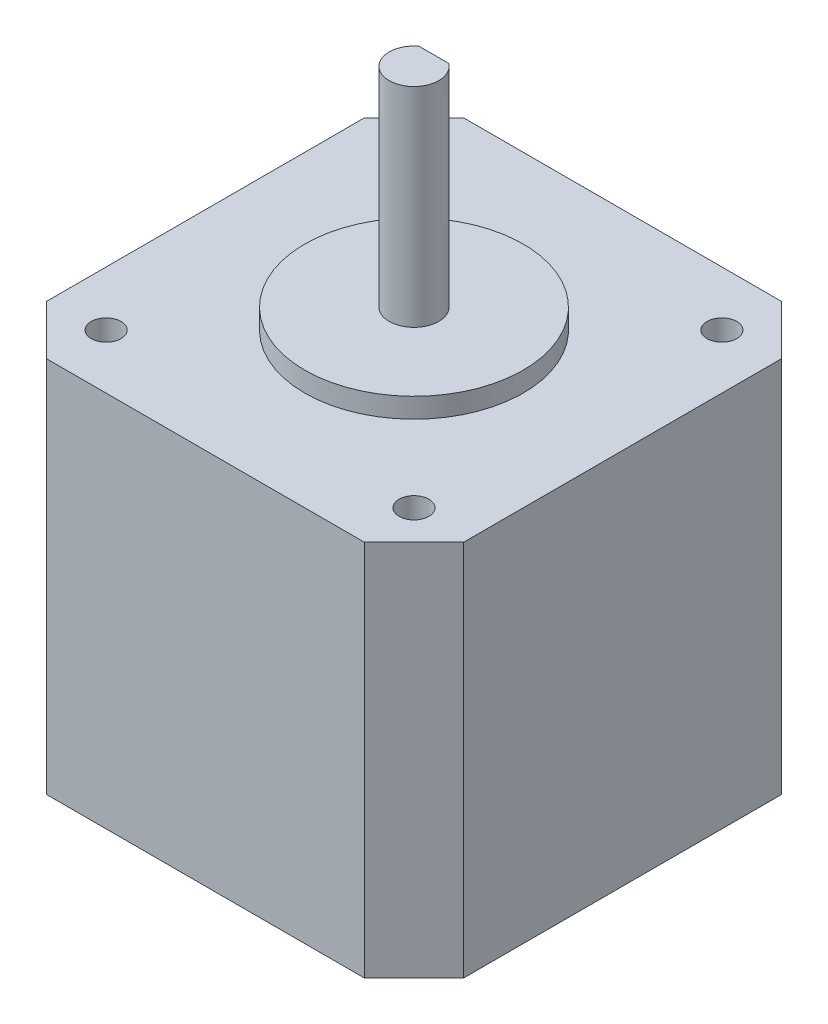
ISO-10303-21;
HEADER;
FILE_DESCRIPTION(('STEP AP214'),'2;1');
FILE_NAME('part.step','',(''),(''),'','','');
FILE_SCHEMA(('AUTOMOTIVE_DESIGN { 1 0 10303 214 1 1 1 1 }'));
ENDSEC;
DATA;
#1=APPLICATION_CONTEXT('core data for automotive mechanical design processes');
#2=APPLICATION_PROTOCOL_DEFINITION('international standard','automotive_design',2000,#1);
#3=PRODUCT_CONTEXT('',#1,'mechanical');
#4=PRODUCT('Part','Part','',(#3));
#5=PRODUCT_RELATED_PRODUCT_CATEGORY('part','',(#4));
#6=PRODUCT_DEFINITION_FORMATION('','',#4);
#7=PRODUCT_DEFINITION_CONTEXT('part definition',#1,'design');
#8=PRODUCT_DEFINITION('design','',#6,#7);
#9=PRODUCT_DEFINITION_SHAPE('','',#8);
#10=(LENGTH_UNIT() NAMED_UNIT(*) SI_UNIT(.MILLI.,.METRE.));
#11=(NAMED_UNIT(*) PLANE_ANGLE_UNIT() SI_UNIT($,.RADIAN.));
#12=(NAMED_UNIT(*) SI_UNIT($,.STERADIAN.) SOLID_ANGLE_UNIT());
#13=UNCERTAINTY_MEASURE_WITH_UNIT(LENGTH_MEASURE(1.E-05),#10,'distance_accuracy_value','');
#14=(GEOMETRIC_REPRESENTATION_CONTEXT(3) GLOBAL_UNCERTAINTY_ASSIGNED_CONTEXT((#13)) GLOBAL_UNIT_ASSIGNED_CONTEXT((#10,
#11,#12)) REPRESENTATION_CONTEXT('',''));
#15=CARTESIAN_POINT('',(0.,0.,0.));
#16=DIRECTION('',(0.,0.,1.));
#17=DIRECTION('',(1.,0.,0.));
#18=AXIS2_PLACEMENT_3D('',#15,#16,#17);
#19=CARTESIAN_POINT('',(-21.,38.,21.));
#20=DIRECTION('',(1.,0.,0.));
#21=DIRECTION('',(0.,0.,-1.));
#22=AXIS2_PLACEMENT_3D('',#19,#20,#21);
#23=PLANE('',#22);
#24=DIRECTION('',(0.,0.,1.));
#25=VECTOR('',#24,1.);
#26=CARTESIAN_POINT('',(-21.,0.,21.));
#27=LINE('',#26,#25);
#28=CARTESIAN_POINT('',(-21.,0.,-16.));
#29=VERTEX_POINT('',#28);
#30=CARTESIAN_POINT('',(-21.,0.,16.));
#31=VERTEX_POINT('',#30);
#32=EDGE_CURVE('E142',#29,#31,#27,.T.);
#33=ORIENTED_EDGE('',*,*,#32,.T.);
#34=DIRECTION('',(0.,1.,0.));
#35=VECTOR('',#34,1.);
#36=CARTESIAN_POINT('',(-21.,38.,16.));
#37=LINE('',#36,#35);
#38=CARTESIAN_POINT('',(-21.,38.,16.));
#39=VERTEX_POINT('',#38);
#40=EDGE_CURVE('E130',#31,#39,#37,.T.);
#41=ORIENTED_EDGE('',*,*,#40,.T.);
#42=DIRECTION('',(0.,0.,1.));
#43=VECTOR('',#42,1.);
#44=CARTESIAN_POINT('',(-21.,38.,21.));
#45=LINE('',#44,#43);
#46=CARTESIAN_POINT('',(-21.,38.,-16.));
#47=VERTEX_POINT('',#46);
#48=EDGE_CURVE('E157',#47,#39,#45,.T.);
#49=ORIENTED_EDGE('',*,*,#48,.F.);
#50=DIRECTION('',(0.,-1.,0.));
#51=VECTOR('',#50,1.);
#52=CARTESIAN_POINT('',(-21.,38.,-16.));
#53=LINE('',#52,#51);
#54=EDGE_CURVE('E206',#47,#29,#53,.T.);
#55=ORIENTED_EDGE('',*,*,#54,.T.);
#56=EDGE_LOOP('',(#33,#41,#49,#55));
#57=FACE_BOUND('',#56,.T.);
#58=ADVANCED_FACE('F45',(#57),#23,.F.);
#59=CARTESIAN_POINT('',(21.,38.,21.));
#60=DIRECTION('',(0.,0.,-1.));
#61=DIRECTION('',(-1.,0.,0.));
#62=AXIS2_PLACEMENT_3D('',#59,#60,#61);
#63=PLANE('',#62);
#64=DIRECTION('',(1.,0.,0.));
#65=VECTOR('',#64,1.);
#66=CARTESIAN_POINT('',(21.,0.,21.));
#67=LINE('',#66,#65);
#68=CARTESIAN_POINT('',(-16.,0.,21.));
#69=VERTEX_POINT('',#68);
#70=CARTESIAN_POINT('',(16.,0.,21.));
#71=VERTEX_POINT('',#70);
#72=EDGE_CURVE('E170',#69,#71,#67,.T.);
#73=ORIENTED_EDGE('',*,*,#72,.T.);
#74=DIRECTION('',(0.,1.,0.));
#75=VECTOR('',#74,1.);
#76=CARTESIAN_POINT('',(16.,38.,21.));
#77=LINE('',#76,#75);
#78=CARTESIAN_POINT('',(16.,38.,21.));
#79=VERTEX_POINT('',#78);
#80=EDGE_CURVE('E69',#71,#79,#77,.T.);
#81=ORIENTED_EDGE('',*,*,#80,.T.);
#82=DIRECTION('',(1.,0.,0.));
#83=VECTOR('',#82,1.);
#84=CARTESIAN_POINT('',(21.,38.,21.));
#85=LINE('',#84,#83);
#86=CARTESIAN_POINT('',(-16.,38.,21.));
#87=VERTEX_POINT('',#86);
#88=EDGE_CURVE('E160',#87,#79,#85,.T.);
#89=ORIENTED_EDGE('',*,*,#88,.F.);
#90=DIRECTION('',(0.,-1.,0.));
#91=VECTOR('',#90,1.);
#92=CARTESIAN_POINT('',(-16.,38.,21.));
#93=LINE('',#92,#91);
#94=EDGE_CURVE('E202',#87,#69,#93,.T.);
#95=ORIENTED_EDGE('',*,*,#94,.T.);
#96=EDGE_LOOP('',(#73,#81,#89,#95));
#97=FACE_BOUND('',#96,.T.);
#98=ADVANCED_FACE('F222',(#97),#63,.F.);
#99=CARTESIAN_POINT('',(21.,38.,21.));
#100=DIRECTION('',(-1.,0.,0.));
#101=DIRECTION('',(0.,0.,1.));
#102=AXIS2_PLACEMENT_3D('',#99,#100,#101);
#103=PLANE('',#102);
#104=DIRECTION('',(0.,0.,-1.));
#105=VECTOR('',#104,1.);
#106=CARTESIAN_POINT('',(21.,0.,21.));
#107=LINE('',#106,#105);
#108=CARTESIAN_POINT('',(21.,0.,16.));
#109=VERTEX_POINT('',#108);
#110=CARTESIAN_POINT('',(21.,0.,-16.));
#111=VERTEX_POINT('',#110);
#112=EDGE_CURVE('E172',#109,#111,#107,.T.);
#113=ORIENTED_EDGE('',*,*,#112,.T.);
#114=DIRECTION('',(0.,1.,0.));
#115=VECTOR('',#114,1.);
#116=CARTESIAN_POINT('',(21.,38.,-16.));
#117=LINE('',#116,#115);
#118=CARTESIAN_POINT('',(21.,38.,-16.));
#119=VERTEX_POINT('',#118);
#120=EDGE_CURVE('E192',#111,#119,#117,.T.);
#121=ORIENTED_EDGE('',*,*,#120,.T.);
#122=DIRECTION('',(0.,0.,-1.));
#123=VECTOR('',#122,1.);
#124=CARTESIAN_POINT('',(21.,38.,21.));
#125=LINE('',#124,#123);
#126=CARTESIAN_POINT('',(21.,38.,16.));
#127=VERTEX_POINT('',#126);
#128=EDGE_CURVE('E163',#127,#119,#125,.T.);
#129=ORIENTED_EDGE('',*,*,#128,.F.);
#130=DIRECTION('',(0.,-1.,0.));
#131=VECTOR('',#130,1.);
#132=CARTESIAN_POINT('',(21.,38.,16.));
#133=LINE('',#132,#131);
#134=EDGE_CURVE('E189',#127,#109,#133,.T.);
#135=ORIENTED_EDGE('',*,*,#134,.T.);
#136=EDGE_LOOP('',(#113,#121,#129,#135));
#137=FACE_BOUND('',#136,.T.);
#138=ADVANCED_FACE('F233',(#137),#103,.F.);
#139=CARTESIAN_POINT('',(21.,38.,-21.));
#140=DIRECTION('',(0.,0.,1.));
#141=DIRECTION('',(1.,0.,0.));
#142=AXIS2_PLACEMENT_3D('',#139,#140,#141);
#143=PLANE('',#142);
#144=DIRECTION('',(-1.,0.,0.));
#145=VECTOR('',#144,1.);
#146=CARTESIAN_POINT('',(21.,38.,-21.));
#147=LINE('',#146,#145);
#148=CARTESIAN_POINT('',(16.,38.,-21.));
#149=VERTEX_POINT('',#148);
#150=CARTESIAN_POINT('',(-16.,38.,-21.));
#151=VERTEX_POINT('',#150);
#152=EDGE_CURVE('E156',#149,#151,#147,.T.);
#153=ORIENTED_EDGE('',*,*,#152,.F.);
#154=DIRECTION('',(0.,-1.,0.));
#155=VECTOR('',#154,1.);
#156=CARTESIAN_POINT('',(16.,38.,-21.));
#157=LINE('',#156,#155);
#158=CARTESIAN_POINT('',(16.,0.,-21.));
#159=VERTEX_POINT('',#158);
#160=EDGE_CURVE('E178',#149,#159,#157,.T.);
#161=ORIENTED_EDGE('',*,*,#160,.T.);
#162=DIRECTION('',(-1.,0.,0.));
#163=VECTOR('',#162,1.);
#164=CARTESIAN_POINT('',(21.,0.,-21.));
#165=LINE('',#164,#163);
#166=CARTESIAN_POINT('',(-16.,0.,-21.));
#167=VERTEX_POINT('',#166);
#168=EDGE_CURVE('E161',#159,#167,#165,.T.);
#169=ORIENTED_EDGE('',*,*,#168,.T.);
#170=DIRECTION('',(0.,1.,0.));
#171=VECTOR('',#170,1.);
#172=CARTESIAN_POINT('',(-16.,38.,-21.));
#173=LINE('',#172,#171);
#174=EDGE_CURVE('E151',#167,#151,#173,.T.);
#175=ORIENTED_EDGE('',*,*,#174,.T.);
#176=EDGE_LOOP('',(#153,#161,#169,#175));
#177=FACE_BOUND('',#176,.T.);
#178=ADVANCED_FACE('F241',(#177),#143,.F.);
#179=CARTESIAN_POINT('',(0.,38.,0.));
#180=DIRECTION('',(0.,1.,0.));
#181=DIRECTION('',(0.,0.,1.));
#182=AXIS2_PLACEMENT_3D('',#179,#180,#181);
#183=PLANE('',#182);
#184=CARTESIAN_POINT('',(-15.5,38.,15.5));
#185=DIRECTION('',(0.,1.,0.));
#186=DIRECTION('',(0.,0.,-1.));
#187=AXIS2_PLACEMENT_3D('',#184,#185,#186);
#188=CIRCLE('',#187,1.5);
#189=CARTESIAN_POINT('',(-15.5,38.,14.));
#190=VERTEX_POINT('',#189);
#191=EDGE_CURVE('E471',#190,#190,#188,.T.);
#192=ORIENTED_EDGE('',*,*,#191,.F.);
#193=EDGE_LOOP('',(#192));
#194=FACE_BOUND('',#193,.T.);
#195=CARTESIAN_POINT('',(15.5,38.,15.5));
#196=DIRECTION('',(0.,1.,0.));
#197=DIRECTION('',(0.,0.,1.));
#198=AXIS2_PLACEMENT_3D('',#195,#196,#197);
#199=CIRCLE('',#198,1.5);
#200=CARTESIAN_POINT('',(15.5,38.,17.));
#201=VERTEX_POINT('',#200);
#202=EDGE_CURVE('E475',#201,#201,#199,.T.);
#203=ORIENTED_EDGE('',*,*,#202,.F.);
#204=EDGE_LOOP('',(#203));
#205=FACE_BOUND('',#204,.T.);
#206=CARTESIAN_POINT('',(15.5,38.,-15.5));
#207=DIRECTION('',(0.,1.,0.));
#208=DIRECTION('',(0.,0.,-1.));
#209=AXIS2_PLACEMENT_3D('',#206,#207,#208);
#210=CIRCLE('',#209,1.5);
#211=CARTESIAN_POINT('',(15.5,38.,-17.));
#212=VERTEX_POINT('',#211);
#213=EDGE_CURVE('E479',#212,#212,#210,.T.);
#214=ORIENTED_EDGE('',*,*,#213,.F.);
#215=EDGE_LOOP('',(#214));
#216=FACE_BOUND('',#215,.T.);
#217=CARTESIAN_POINT('',(-15.5,38.,-15.5));
#218=DIRECTION('',(0.,1.,0.));
#219=DIRECTION('',(0.,0.,1.));
#220=AXIS2_PLACEMENT_3D('',#217,#218,#219);
#221=CIRCLE('',#220,1.5);
#222=CARTESIAN_POINT('',(-15.5,38.,-14.));
#223=VERTEX_POINT('',#222);
#224=EDGE_CURVE('E145',#223,#223,#221,.T.);
#225=ORIENTED_EDGE('',*,*,#224,.F.);
#226=EDGE_LOOP('',(#225));
#227=FACE_BOUND('',#226,.T.);
#228=CARTESIAN_POINT('',(0.,38.,0.));
#229=DIRECTION('',(0.,1.,0.));
#230=DIRECTION('',(0.,0.,1.));
#231=AXIS2_PLACEMENT_3D('',#228,#229,#230);
#232=CIRCLE('',#231,11.);
#233=CARTESIAN_POINT('',(0.,38.,11.));
#234=VERTEX_POINT('',#233);
#235=EDGE_CURVE('E152',#234,#234,#232,.T.);
#236=ORIENTED_EDGE('',*,*,#235,.F.);
#237=EDGE_LOOP('',(#236));
#238=FACE_BOUND('',#237,.T.);
#239=ORIENTED_EDGE('',*,*,#128,.T.);
#240=DIRECTION('',(0.707106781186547,0.,0.707106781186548));
#241=VECTOR('',#240,1.);
#242=CARTESIAN_POINT('',(18.5,38.,-18.5));
#243=LINE('',#242,#241);
#244=EDGE_CURVE('E200',#119,#149,#243,.F.);
#245=ORIENTED_EDGE('',*,*,#244,.T.);
#246=ORIENTED_EDGE('',*,*,#152,.T.);
#247=DIRECTION('',(0.707106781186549,0.,-0.707106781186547));
#248=VECTOR('',#247,1.);
#249=CARTESIAN_POINT('',(-18.5,38.,-18.5));
#250=LINE('',#249,#248);
#251=EDGE_CURVE('E194',#151,#47,#250,.F.);
#252=ORIENTED_EDGE('',*,*,#251,.T.);
#253=ORIENTED_EDGE('',*,*,#48,.T.);
#254=DIRECTION('',(-0.707106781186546,0.,-0.70710678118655));
#255=VECTOR('',#254,1.);
#256=CARTESIAN_POINT('',(-18.5,38.,18.4999999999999));
#257=LINE('',#256,#255);
#258=EDGE_CURVE('E196',#39,#87,#257,.F.);
#259=ORIENTED_EDGE('',*,*,#258,.T.);
#260=ORIENTED_EDGE('',*,*,#88,.T.);
#261=DIRECTION('',(-0.707106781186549,0.,0.707106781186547));
#262=VECTOR('',#261,1.);
#263=CARTESIAN_POINT('',(18.5,38.,18.5));
#264=LINE('',#263,#262);
#265=EDGE_CURVE('E198',#79,#127,#264,.F.);
#266=ORIENTED_EDGE('',*,*,#265,.T.);
#267=EDGE_LOOP('',(#239,#245,#246,#252,#253,#259,#260,#266));
#268=FACE_BOUND('',#267,.T.);
#269=ADVANCED_FACE('F217',(#194,#205,#216,#227,#238,#268),#183,.T.);
#270=CARTESIAN_POINT('',(0.,0.,0.));
#271=DIRECTION('',(0.,1.,0.));
#272=DIRECTION('',(0.,0.,1.));
#273=AXIS2_PLACEMENT_3D('',#270,#271,#272);
#274=PLANE('',#273);
#275=ORIENTED_EDGE('',*,*,#168,.F.);
#276=DIRECTION('',(-0.707106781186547,0.,-0.707106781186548));
#277=VECTOR('',#276,1.);
#278=CARTESIAN_POINT('',(16.,0.,-21.));
#279=LINE('',#278,#277);
#280=EDGE_CURVE('E187',#159,#111,#279,.F.);
#281=ORIENTED_EDGE('',*,*,#280,.T.);
#282=ORIENTED_EDGE('',*,*,#112,.F.);
#283=DIRECTION('',(0.707106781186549,0.,-0.707106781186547));
#284=VECTOR('',#283,1.);
#285=CARTESIAN_POINT('',(21.,0.,16.));
#286=LINE('',#285,#284);
#287=EDGE_CURVE('E185',#109,#71,#286,.F.);
#288=ORIENTED_EDGE('',*,*,#287,.T.);
#289=ORIENTED_EDGE('',*,*,#72,.F.);
#290=DIRECTION('',(0.707106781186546,0.,0.70710678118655));
#291=VECTOR('',#290,1.);
#292=CARTESIAN_POINT('',(-16.,0.,21.));
#293=LINE('',#292,#291);
#294=EDGE_CURVE('E183',#69,#31,#293,.F.);
#295=ORIENTED_EDGE('',*,*,#294,.T.);
#296=ORIENTED_EDGE('',*,*,#32,.F.);
#297=DIRECTION('',(-0.707106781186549,0.,0.707106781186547));
#298=VECTOR('',#297,1.);
#299=CARTESIAN_POINT('',(-21.,0.,-16.));
#300=LINE('',#299,#298);
#301=EDGE_CURVE('E181',#29,#167,#300,.F.);
#302=ORIENTED_EDGE('',*,*,#301,.T.);
#303=EDGE_LOOP('',(#275,#281,#282,#288,#289,#295,#296,#302));
#304=FACE_BOUND('',#303,.T.);
#305=ADVANCED_FACE('F225',(#304),#274,.F.);
#306=CARTESIAN_POINT('',(0.,40.,0.));
#307=DIRECTION('',(0.,-1.,0.));
#308=DIRECTION('',(0.,0.,-1.));
#309=AXIS2_PLACEMENT_3D('',#306,#307,#308);
#310=CYLINDRICAL_SURFACE('',#309,11.);
#311=CARTESIAN_POINT('',(0.,40.,0.));
#312=DIRECTION('',(0.,1.,0.));
#313=DIRECTION('',(0.,0.,1.));
#314=AXIS2_PLACEMENT_3D('',#311,#312,#313);
#315=CIRCLE('',#314,11.);
#316=CARTESIAN_POINT('',(0.,40.,11.));
#317=VERTEX_POINT('',#316);
#318=EDGE_CURVE('E138',#317,#317,#315,.T.);
#319=ORIENTED_EDGE('',*,*,#318,.F.);
#320=EDGE_LOOP('',(#319));
#321=FACE_BOUND('',#320,.T.);
#322=ORIENTED_EDGE('',*,*,#235,.T.);
#323=EDGE_LOOP('',(#322));
#324=FACE_BOUND('',#323,.T.);
#325=ADVANCED_FACE('F346',(#321,#324),#310,.T.);
#326=CARTESIAN_POINT('',(0.,40.,0.));
#327=DIRECTION('',(0.,1.,0.));
#328=DIRECTION('',(0.,0.,1.));
#329=AXIS2_PLACEMENT_3D('',#326,#327,#328);
#330=PLANE('',#329);
#331=CARTESIAN_POINT('',(0.,40.,0.));
#332=DIRECTION('',(0.,1.,0.));
#333=DIRECTION('',(0.,0.,1.));
#334=AXIS2_PLACEMENT_3D('',#331,#332,#333);
#335=CIRCLE('',#334,2.5);
#336=CARTESIAN_POINT('',(0.,40.,2.5));
#337=VERTEX_POINT('',#336);
#338=EDGE_CURVE('E149',#337,#337,#335,.T.);
#339=ORIENTED_EDGE('',*,*,#338,.F.);
#340=EDGE_LOOP('',(#339));
#341=FACE_BOUND('',#340,.T.);
#342=ORIENTED_EDGE('',*,*,#318,.T.);
#343=EDGE_LOOP('',(#342));
#344=FACE_BOUND('',#343,.T.);
#345=ADVANCED_FACE('F343',(#341,#344),#330,.T.);
#346=CARTESIAN_POINT('',(0.,61.,0.));
#347=DIRECTION('',(0.,-1.,0.));
#348=DIRECTION('',(0.,0.,-1.));
#349=AXIS2_PLACEMENT_3D('',#346,#347,#348);
#350=CYLINDRICAL_SURFACE('',#349,2.5);
#351=CARTESIAN_POINT('',(0.,61.,0.));
#352=DIRECTION('',(0.,1.,0.));
#353=DIRECTION('',(0.,0.,1.));
#354=AXIS2_PLACEMENT_3D('',#351,#352,#353);
#355=CIRCLE('',#354,2.5);
#356=CARTESIAN_POINT('',(-1.5,61.,-2.));
#357=VERTEX_POINT('',#356);
#358=CARTESIAN_POINT('',(1.5,61.,-2.));
#359=VERTEX_POINT('',#358);
#360=EDGE_CURVE('E134',#357,#359,#355,.T.);
#361=ORIENTED_EDGE('',*,*,#360,.F.);
#362=DIRECTION('',(0.,-1.,0.));
#363=VECTOR('',#362,1.);
#364=CARTESIAN_POINT('',(-1.5,61.,-2.));
#365=LINE('',#364,#363);
#366=CARTESIAN_POINT('',(-1.5,42.,-2.));
#367=VERTEX_POINT('',#366);
#368=EDGE_CURVE('E61',#357,#367,#365,.T.);
#369=ORIENTED_EDGE('',*,*,#368,.T.);
#370=CARTESIAN_POINT('',(0.,42.,0.));
#371=DIRECTION('',(0.,-1.,0.));
#372=DIRECTION('',(0.,0.,-1.));
#373=AXIS2_PLACEMENT_3D('',#370,#371,#372);
#374=CIRCLE('',#373,2.5);
#375=CARTESIAN_POINT('',(1.5,42.,-2.));
#376=VERTEX_POINT('',#375);
#377=EDGE_CURVE('E11',#367,#376,#374,.T.);
#378=ORIENTED_EDGE('',*,*,#377,.T.);
#379=DIRECTION('',(0.,-1.,0.));
#380=VECTOR('',#379,1.);
#381=CARTESIAN_POINT('',(1.5,61.,-2.));
#382=LINE('',#381,#380);
#383=EDGE_CURVE('E125',#376,#359,#382,.F.);
#384=ORIENTED_EDGE('',*,*,#383,.T.);
#385=EDGE_LOOP('',(#361,#369,#378,#384));
#386=FACE_BOUND('',#385,.T.);
#387=ORIENTED_EDGE('',*,*,#338,.T.);
#388=EDGE_LOOP('',(#387));
#389=FACE_BOUND('',#388,.T.);
#390=ADVANCED_FACE('F132',(#386,#389),#350,.T.);
#391=CARTESIAN_POINT('',(0.,61.,0.));
#392=DIRECTION('',(0.,1.,0.));
#393=DIRECTION('',(0.,0.,1.));
#394=AXIS2_PLACEMENT_3D('',#391,#392,#393);
#395=PLANE('',#394);
#396=DIRECTION('',(1.,0.,0.));
#397=VECTOR('',#396,1.);
#398=CARTESIAN_POINT('',(0.,61.,-2.));
#399=LINE('',#398,#397);
#400=EDGE_CURVE('E54',#357,#359,#399,.T.);
#401=ORIENTED_EDGE('',*,*,#400,.F.);
#402=ORIENTED_EDGE('',*,*,#360,.T.);
#403=EDGE_LOOP('',(#401,#402));
#404=FACE_BOUND('',#403,.T.);
#405=ADVANCED_FACE('F137',(#404),#395,.T.);
#406=CARTESIAN_POINT('',(-15.5,28.,-15.5));
#407=DIRECTION('',(0.,1.,0.));
#408=DIRECTION('',(0.,0.,1.));
#409=AXIS2_PLACEMENT_3D('',#406,#407,#408);
#410=CYLINDRICAL_SURFACE('',#409,1.5);
#411=CARTESIAN_POINT('',(-15.5,28.,-15.5));
#412=DIRECTION('',(0.,1.,0.));
#413=DIRECTION('',(0.,0.,1.));
#414=AXIS2_PLACEMENT_3D('',#411,#412,#413);
#415=CIRCLE('',#414,1.5);
#416=CARTESIAN_POINT('',(-15.5,28.,-14.));
#417=VERTEX_POINT('',#416);
#418=EDGE_CURVE('E139',#417,#417,#415,.T.);
#419=ORIENTED_EDGE('',*,*,#418,.F.);
#420=EDGE_LOOP('',(#419));
#421=FACE_BOUND('',#420,.T.);
#422=ORIENTED_EDGE('',*,*,#224,.T.);
#423=EDGE_LOOP('',(#422));
#424=FACE_BOUND('',#423,.T.);
#425=ADVANCED_FACE('F336',(#421,#424),#410,.F.);
#426=CARTESIAN_POINT('',(-15.5,28.,-15.5));
#427=DIRECTION('',(0.,1.,0.));
#428=DIRECTION('',(0.,0.,1.));
#429=AXIS2_PLACEMENT_3D('',#426,#427,#428);
#430=PLANE('',#429);
#431=ORIENTED_EDGE('',*,*,#418,.T.);
#432=EDGE_LOOP('',(#431));
#433=FACE_BOUND('',#432,.T.);
#434=ADVANCED_FACE('F315',(#433),#430,.T.);
#435=CARTESIAN_POINT('',(15.5,28.,-15.5));
#436=DIRECTION('',(0.,1.,0.));
#437=DIRECTION('',(0.,0.,1.));
#438=AXIS2_PLACEMENT_3D('',#435,#436,#437);
#439=CYLINDRICAL_SURFACE('',#438,1.5);
#440=CARTESIAN_POINT('',(15.5,28.,-15.5));
#441=DIRECTION('',(0.,1.,0.));
#442=DIRECTION('',(0.,0.,-1.));
#443=AXIS2_PLACEMENT_3D('',#440,#441,#442);
#444=CIRCLE('',#443,1.5);
#445=CARTESIAN_POINT('',(15.5,28.,-17.));
#446=VERTEX_POINT('',#445);
#447=EDGE_CURVE('E486',#446,#446,#444,.T.);
#448=ORIENTED_EDGE('',*,*,#447,.F.);
#449=EDGE_LOOP('',(#448));
#450=FACE_BOUND('',#449,.T.);
#451=ORIENTED_EDGE('',*,*,#213,.T.);
#452=EDGE_LOOP('',(#451));
#453=FACE_BOUND('',#452,.T.);
#454=ADVANCED_FACE('F311',(#450,#453),#439,.F.);
#455=CARTESIAN_POINT('',(15.5,28.,-15.5));
#456=DIRECTION('',(0.,-1.,0.));
#457=DIRECTION('',(0.,0.,-1.));
#458=AXIS2_PLACEMENT_3D('',#455,#456,#457);
#459=PLANE('',#458);
#460=ORIENTED_EDGE('',*,*,#447,.T.);
#461=EDGE_LOOP('',(#460));
#462=FACE_BOUND('',#461,.T.);
#463=ADVANCED_FACE('F314',(#462),#459,.F.);
#464=CARTESIAN_POINT('',(15.5,28.,15.5));
#465=DIRECTION('',(0.,1.,0.));
#466=DIRECTION('',(0.,0.,1.));
#467=AXIS2_PLACEMENT_3D('',#464,#465,#466);
#468=CYLINDRICAL_SURFACE('',#467,1.5);
#469=CARTESIAN_POINT('',(15.5,28.,15.5));
#470=DIRECTION('',(0.,1.,0.));
#471=DIRECTION('',(0.,0.,1.));
#472=AXIS2_PLACEMENT_3D('',#469,#470,#471);
#473=CIRCLE('',#472,1.5);
#474=CARTESIAN_POINT('',(15.5,28.,17.));
#475=VERTEX_POINT('',#474);
#476=EDGE_CURVE('E494',#475,#475,#473,.T.);
#477=ORIENTED_EDGE('',*,*,#476,.F.);
#478=EDGE_LOOP('',(#477));
#479=FACE_BOUND('',#478,.T.);
#480=ORIENTED_EDGE('',*,*,#202,.T.);
#481=EDGE_LOOP('',(#480));
#482=FACE_BOUND('',#481,.T.);
#483=ADVANCED_FACE('F319',(#479,#482),#468,.F.);
#484=CARTESIAN_POINT('',(15.5,28.,15.5));
#485=DIRECTION('',(0.,1.,0.));
#486=DIRECTION('',(0.,0.,1.));
#487=AXIS2_PLACEMENT_3D('',#484,#485,#486);
#488=PLANE('',#487);
#489=ORIENTED_EDGE('',*,*,#476,.T.);
#490=EDGE_LOOP('',(#489));
#491=FACE_BOUND('',#490,.T.);
#492=ADVANCED_FACE('F323',(#491),#488,.T.);
#493=CARTESIAN_POINT('',(-15.5,28.,15.5));
#494=DIRECTION('',(0.,1.,0.));
#495=DIRECTION('',(0.,0.,1.));
#496=AXIS2_PLACEMENT_3D('',#493,#494,#495);
#497=CYLINDRICAL_SURFACE('',#496,1.5);
#498=CARTESIAN_POINT('',(-15.5,28.,15.5));
#499=DIRECTION('',(0.,1.,0.));
#500=DIRECTION('',(0.,0.,-1.));
#501=AXIS2_PLACEMENT_3D('',#498,#499,#500);
#502=CIRCLE('',#501,1.5);
#503=CARTESIAN_POINT('',(-15.5,28.,14.));
#504=VERTEX_POINT('',#503);
#505=EDGE_CURVE('E498',#504,#504,#502,.T.);
#506=ORIENTED_EDGE('',*,*,#505,.F.);
#507=EDGE_LOOP('',(#506));
#508=FACE_BOUND('',#507,.T.);
#509=ORIENTED_EDGE('',*,*,#191,.T.);
#510=EDGE_LOOP('',(#509));
#511=FACE_BOUND('',#510,.T.);
#512=ADVANCED_FACE('F327',(#508,#511),#497,.F.);
#513=CARTESIAN_POINT('',(-15.5,28.,15.5));
#514=DIRECTION('',(0.,-1.,0.));
#515=DIRECTION('',(0.,0.,-1.));
#516=AXIS2_PLACEMENT_3D('',#513,#514,#515);
#517=PLANE('',#516);
#518=ORIENTED_EDGE('',*,*,#505,.T.);
#519=EDGE_LOOP('',(#518));
#520=FACE_BOUND('',#519,.T.);
#521=ADVANCED_FACE('F268',(#520),#517,.F.);
#522=CARTESIAN_POINT('',(16.,38.,-21.));
#523=DIRECTION('',(-0.707106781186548,0.,0.707106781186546));
#524=DIRECTION('',(0.,-1.,0.));
#525=AXIS2_PLACEMENT_3D('',#522,#523,#524);
#526=PLANE('',#525);
#527=ORIENTED_EDGE('',*,*,#244,.F.);
#528=ORIENTED_EDGE('',*,*,#120,.F.);
#529=ORIENTED_EDGE('',*,*,#280,.F.);
#530=ORIENTED_EDGE('',*,*,#160,.F.);
#531=EDGE_LOOP('',(#527,#528,#529,#530));
#532=FACE_BOUND('',#531,.T.);
#533=ADVANCED_FACE('F239',(#532),#526,.F.);
#534=CARTESIAN_POINT('',(21.,38.,16.));
#535=DIRECTION('',(-0.707106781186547,0.,-0.707106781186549));
#536=DIRECTION('',(0.,-1.,0.));
#537=AXIS2_PLACEMENT_3D('',#534,#535,#536);
#538=PLANE('',#537);
#539=ORIENTED_EDGE('',*,*,#265,.F.);
#540=ORIENTED_EDGE('',*,*,#80,.F.);
#541=ORIENTED_EDGE('',*,*,#287,.F.);
#542=ORIENTED_EDGE('',*,*,#134,.F.);
#543=EDGE_LOOP('',(#539,#540,#541,#542));
#544=FACE_BOUND('',#543,.T.);
#545=ADVANCED_FACE('F230',(#544),#538,.F.);
#546=CARTESIAN_POINT('',(-16.,38.,21.));
#547=DIRECTION('',(0.70710678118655,0.,-0.707106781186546));
#548=DIRECTION('',(0.,-1.,0.));
#549=AXIS2_PLACEMENT_3D('',#546,#547,#548);
#550=PLANE('',#549);
#551=ORIENTED_EDGE('',*,*,#258,.F.);
#552=ORIENTED_EDGE('',*,*,#40,.F.);
#553=ORIENTED_EDGE('',*,*,#294,.F.);
#554=ORIENTED_EDGE('',*,*,#94,.F.);
#555=EDGE_LOOP('',(#551,#552,#553,#554));
#556=FACE_BOUND('',#555,.T.);
#557=ADVANCED_FACE('F220',(#556),#550,.F.);
#558=CARTESIAN_POINT('',(-21.,38.,-16.));
#559=DIRECTION('',(0.707106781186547,0.,0.707106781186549));
#560=DIRECTION('',(0.,-1.,0.));
#561=AXIS2_PLACEMENT_3D('',#558,#559,#560);
#562=PLANE('',#561);
#563=ORIENTED_EDGE('',*,*,#251,.F.);
#564=ORIENTED_EDGE('',*,*,#174,.F.);
#565=ORIENTED_EDGE('',*,*,#301,.F.);
#566=ORIENTED_EDGE('',*,*,#54,.F.);
#567=EDGE_LOOP('',(#563,#564,#565,#566));
#568=FACE_BOUND('',#567,.T.);
#569=ADVANCED_FACE('F48',(#568),#562,.F.);
#570=CARTESIAN_POINT('',(0.,42.,0.));
#571=DIRECTION('',(0.,-1.,0.));
#572=DIRECTION('',(0.,0.,-1.));
#573=AXIS2_PLACEMENT_3D('',#570,#571,#572);
#574=PLANE('',#573);
#575=DIRECTION('',(1.,0.,0.));
#576=VECTOR('',#575,1.);
#577=CARTESIAN_POINT('',(-3.45789734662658,42.,-2.));
#578=LINE('',#577,#576);
#579=EDGE_CURVE('E135',#367,#376,#578,.T.);
#580=ORIENTED_EDGE('',*,*,#579,.T.);
#581=ORIENTED_EDGE('',*,*,#377,.F.);
#582=EDGE_LOOP('',(#580,#581));
#583=FACE_BOUND('',#582,.T.);
#584=ADVANCED_FACE('F245',(#583),#574,.F.);
#585=CARTESIAN_POINT('',(-3.45789734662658,42.,-2.));
#586=DIRECTION('',(0.,0.,1.));
#587=DIRECTION('',(1.,0.,0.));
#588=AXIS2_PLACEMENT_3D('',#585,#586,#587);
#589=PLANE('',#588);
#590=ORIENTED_EDGE('',*,*,#400,.T.);
#591=ORIENTED_EDGE('',*,*,#383,.F.);
#592=ORIENTED_EDGE('',*,*,#579,.F.);
#593=ORIENTED_EDGE('',*,*,#368,.F.);
#594=EDGE_LOOP('',(#590,#591,#592,#593));
#595=FACE_BOUND('',#594,.T.);
#596=ADVANCED_FACE('F124',(#595),#589,.F.);
#597=CLOSED_SHELL('',(#58,#98,#138,#178,#269,#305,#325,#345,#390,#405,#425,#434,#454,#463,#483,
#492,#512,#521,#533,#545,#557,#569,#584,#596));
#598=MANIFOLD_SOLID_BREP('B2',#597);
#599=ADVANCED_BREP_SHAPE_REPRESENTATION('',(#18,#598),#14);
#600=SHAPE_DEFINITION_REPRESENTATION(#9,#599);
ENDSEC;
END-ISO-10303-21;
